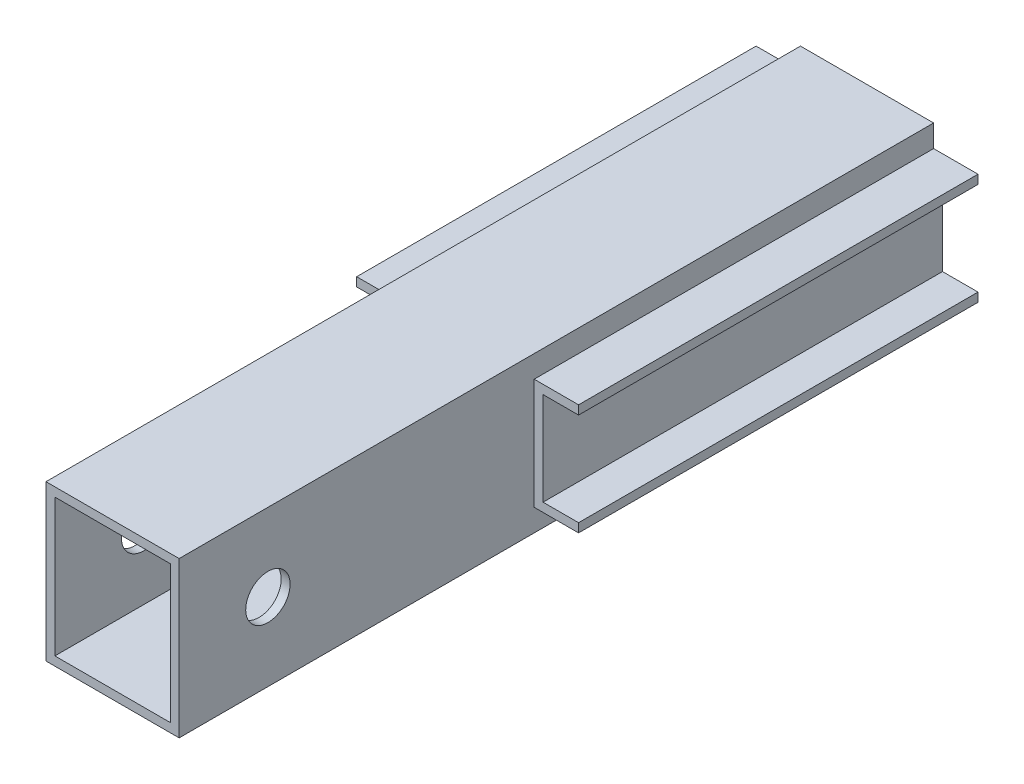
ISO-10303-21;
HEADER;
FILE_DESCRIPTION(('STEP AP214'),'2;1');
FILE_NAME('part.step','',(''),(''),'','','');
FILE_SCHEMA(('AUTOMOTIVE_DESIGN { 1 0 10303 214 1 1 1 1 }'));
ENDSEC;
DATA;
#1=APPLICATION_CONTEXT('core data for automotive mechanical design processes');
#2=APPLICATION_PROTOCOL_DEFINITION('international standard','automotive_design',2000,#1);
#3=PRODUCT_CONTEXT('',#1,'mechanical');
#4=PRODUCT('Part','Part','',(#3));
#5=PRODUCT_RELATED_PRODUCT_CATEGORY('part','',(#4));
#6=PRODUCT_DEFINITION_FORMATION('','',#4);
#7=PRODUCT_DEFINITION_CONTEXT('part definition',#1,'design');
#8=PRODUCT_DEFINITION('design','',#6,#7);
#9=PRODUCT_DEFINITION_SHAPE('','',#8);
#10=(LENGTH_UNIT() NAMED_UNIT(*) SI_UNIT(.MILLI.,.METRE.));
#11=(NAMED_UNIT(*) PLANE_ANGLE_UNIT() SI_UNIT($,.RADIAN.));
#12=(NAMED_UNIT(*) SI_UNIT($,.STERADIAN.) SOLID_ANGLE_UNIT());
#13=UNCERTAINTY_MEASURE_WITH_UNIT(LENGTH_MEASURE(1.E-05),#10,'distance_accuracy_value','');
#14=(GEOMETRIC_REPRESENTATION_CONTEXT(3) GLOBAL_UNCERTAINTY_ASSIGNED_CONTEXT((#13)) GLOBAL_UNIT_ASSIGNED_CONTEXT((#10,
#11,#12)) REPRESENTATION_CONTEXT('',''));
#15=CARTESIAN_POINT('',(0.,0.,0.));
#16=DIRECTION('',(0.,0.,1.));
#17=DIRECTION('',(1.,0.,0.));
#18=AXIS2_PLACEMENT_3D('',#15,#16,#17);
#19=CARTESIAN_POINT('',(15.,17.5,530.));
#20=DIRECTION('',(-1.,0.,0.));
#21=DIRECTION('',(0.,0.,1.));
#22=AXIS2_PLACEMENT_3D('',#19,#20,#21);
#23=PLANE('',#22);
#24=CARTESIAN_POINT('',(15.,0.,510.));
#25=DIRECTION('',(1.,0.,0.));
#26=DIRECTION('',(0.,1.,0.));
#27=AXIS2_PLACEMENT_3D('',#24,#25,#26);
#28=CIRCLE('',#27,5.00000000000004);
#29=CARTESIAN_POINT('',(15.,5.00000000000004,510.));
#30=VERTEX_POINT('',#29);
#31=EDGE_CURVE('E220',#30,#30,#28,.T.);
#32=ORIENTED_EDGE('',*,*,#31,.F.);
#33=EDGE_LOOP('',(#32));
#34=FACE_BOUND('',#33,.T.);
#35=DIRECTION('',(0.,0.,-1.));
#36=VECTOR('',#35,1.);
#37=CARTESIAN_POINT('',(15.,-17.5,530.));
#38=LINE('',#37,#36);
#39=CARTESIAN_POINT('',(15.,-17.5,530.));
#40=VERTEX_POINT('',#39);
#41=CARTESIAN_POINT('',(15.,-17.5,360.));
#42=VERTEX_POINT('',#41);
#43=EDGE_CURVE('E214',#40,#42,#38,.T.);
#44=ORIENTED_EDGE('',*,*,#43,.T.);
#45=DIRECTION('',(0.,1.,0.));
#46=VECTOR('',#45,1.);
#47=CARTESIAN_POINT('',(15.,17.5,360.));
#48=LINE('',#47,#46);
#49=CARTESIAN_POINT('',(15.,-12.5,360.));
#50=VERTEX_POINT('',#49);
#51=EDGE_CURVE('E359',#42,#50,#48,.T.);
#52=ORIENTED_EDGE('',*,*,#51,.T.);
#53=DIRECTION('',(0.,0.,-1.));
#54=VECTOR('',#53,1.);
#55=CARTESIAN_POINT('',(15.,-12.5,450.));
#56=LINE('',#55,#54);
#57=CARTESIAN_POINT('',(15.,-12.5,450.));
#58=VERTEX_POINT('',#57);
#59=EDGE_CURVE('E305',#58,#50,#56,.T.);
#60=ORIENTED_EDGE('',*,*,#59,.F.);
#61=DIRECTION('',(0.,-1.,0.));
#62=VECTOR('',#61,1.);
#63=CARTESIAN_POINT('',(15.,12.5,450.));
#64=LINE('',#63,#62);
#65=CARTESIAN_POINT('',(15.,12.5,450.));
#66=VERTEX_POINT('',#65);
#67=EDGE_CURVE('E297',#66,#58,#64,.T.);
#68=ORIENTED_EDGE('',*,*,#67,.F.);
#69=DIRECTION('',(0.,0.,-1.));
#70=VECTOR('',#69,1.);
#71=CARTESIAN_POINT('',(15.,12.5,450.));
#72=LINE('',#71,#70);
#73=CARTESIAN_POINT('',(15.,12.5,360.));
#74=VERTEX_POINT('',#73);
#75=EDGE_CURVE('E308',#66,#74,#72,.T.);
#76=ORIENTED_EDGE('',*,*,#75,.T.);
#77=CARTESIAN_POINT('',(15.,17.5,360.));
#78=VERTEX_POINT('',#77);
#79=EDGE_CURVE('E384',#74,#78,#48,.T.);
#80=ORIENTED_EDGE('',*,*,#79,.T.);
#81=DIRECTION('',(0.,0.,-1.));
#82=VECTOR('',#81,1.);
#83=CARTESIAN_POINT('',(15.,17.5,530.));
#84=LINE('',#83,#82);
#85=CARTESIAN_POINT('',(15.,17.5,530.));
#86=VERTEX_POINT('',#85);
#87=EDGE_CURVE('E35',#86,#78,#84,.T.);
#88=ORIENTED_EDGE('',*,*,#87,.F.);
#89=DIRECTION('',(0.,1.,0.));
#90=VECTOR('',#89,1.);
#91=CARTESIAN_POINT('',(15.,17.5,530.));
#92=LINE('',#91,#90);
#93=EDGE_CURVE('E347',#40,#86,#92,.T.);
#94=ORIENTED_EDGE('',*,*,#93,.F.);
#95=EDGE_LOOP('',(#44,#52,#60,#68,#76,#80,#88,#94));
#96=FACE_BOUND('',#95,.T.);
#97=ADVANCED_FACE('F28',(#34,#96),#23,.F.);
#98=CARTESIAN_POINT('',(15.,17.5,530.));
#99=DIRECTION('',(0.,0.,1.));
#100=DIRECTION('',(1.,0.,0.));
#101=AXIS2_PLACEMENT_3D('',#98,#99,#100);
#102=PLANE('',#101);
#103=ORIENTED_EDGE('',*,*,#93,.T.);
#104=DIRECTION('',(-1.,0.,0.));
#105=VECTOR('',#104,1.);
#106=CARTESIAN_POINT('',(-15.,17.5,530.));
#107=LINE('',#106,#105);
#108=CARTESIAN_POINT('',(-15.,17.5,530.));
#109=VERTEX_POINT('',#108);
#110=EDGE_CURVE('E350',#86,#109,#107,.T.);
#111=ORIENTED_EDGE('',*,*,#110,.T.);
#112=DIRECTION('',(0.,-1.,0.));
#113=VECTOR('',#112,1.);
#114=CARTESIAN_POINT('',(-15.,17.5,530.));
#115=LINE('',#114,#113);
#116=CARTESIAN_POINT('',(-15.,-17.5,530.));
#117=VERTEX_POINT('',#116);
#118=EDGE_CURVE('E209',#109,#117,#115,.T.);
#119=ORIENTED_EDGE('',*,*,#118,.T.);
#120=DIRECTION('',(1.,0.,0.));
#121=VECTOR('',#120,1.);
#122=CARTESIAN_POINT('',(-15.,-17.5,530.));
#123=LINE('',#122,#121);
#124=EDGE_CURVE('E353',#117,#40,#123,.T.);
#125=ORIENTED_EDGE('',*,*,#124,.T.);
#126=EDGE_LOOP('',(#103,#111,#119,#125));
#127=FACE_BOUND('',#126,.T.);
#128=DIRECTION('',(-1.,0.,0.));
#129=VECTOR('',#128,1.);
#130=CARTESIAN_POINT('',(-13.,15.5,530.));
#131=LINE('',#130,#129);
#132=CARTESIAN_POINT('',(13.,15.5,530.));
#133=VERTEX_POINT('',#132);
#134=CARTESIAN_POINT('',(-13.,15.5,530.));
#135=VERTEX_POINT('',#134);
#136=EDGE_CURVE('E328',#133,#135,#131,.T.);
#137=ORIENTED_EDGE('',*,*,#136,.F.);
#138=DIRECTION('',(0.,1.,0.));
#139=VECTOR('',#138,1.);
#140=CARTESIAN_POINT('',(13.,15.5,530.));
#141=LINE('',#140,#139);
#142=CARTESIAN_POINT('',(13.,-15.5,530.));
#143=VERTEX_POINT('',#142);
#144=EDGE_CURVE('E326',#143,#133,#141,.T.);
#145=ORIENTED_EDGE('',*,*,#144,.F.);
#146=DIRECTION('',(1.,0.,0.));
#147=VECTOR('',#146,1.);
#148=CARTESIAN_POINT('',(-13.,-15.5,530.));
#149=LINE('',#148,#147);
#150=CARTESIAN_POINT('',(-13.,-15.5,530.));
#151=VERTEX_POINT('',#150);
#152=EDGE_CURVE('E333',#151,#143,#149,.T.);
#153=ORIENTED_EDGE('',*,*,#152,.F.);
#154=DIRECTION('',(0.,-1.,0.));
#155=VECTOR('',#154,1.);
#156=CARTESIAN_POINT('',(-13.,15.5,530.));
#157=LINE('',#156,#155);
#158=EDGE_CURVE('E330',#135,#151,#157,.T.);
#159=ORIENTED_EDGE('',*,*,#158,.F.);
#160=EDGE_LOOP('',(#137,#145,#153,#159));
#161=FACE_BOUND('',#160,.T.);
#162=ADVANCED_FACE('F414',(#127,#161),#102,.T.);
#163=CARTESIAN_POINT('',(-15.,17.5,530.));
#164=DIRECTION('',(0.,-1.,0.));
#165=DIRECTION('',(0.,0.,-1.));
#166=AXIS2_PLACEMENT_3D('',#163,#164,#165);
#167=PLANE('',#166);
#168=ORIENTED_EDGE('',*,*,#87,.T.);
#169=DIRECTION('',(1.,0.,0.));
#170=VECTOR('',#169,1.);
#171=CARTESIAN_POINT('',(51.143348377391,17.5,360.));
#172=LINE('',#171,#170);
#173=CARTESIAN_POINT('',(-15.,17.5,360.));
#174=VERTEX_POINT('',#173);
#175=EDGE_CURVE('E188',#174,#78,#172,.T.);
#176=ORIENTED_EDGE('',*,*,#175,.F.);
#177=DIRECTION('',(0.,0.,-1.));
#178=VECTOR('',#177,1.);
#179=CARTESIAN_POINT('',(-15.,17.5,530.));
#180=LINE('',#179,#178);
#181=EDGE_CURVE('E202',#109,#174,#180,.T.);
#182=ORIENTED_EDGE('',*,*,#181,.F.);
#183=ORIENTED_EDGE('',*,*,#110,.F.);
#184=EDGE_LOOP('',(#168,#176,#182,#183));
#185=FACE_BOUND('',#184,.T.);
#186=ADVANCED_FACE('F201',(#185),#167,.F.);
#187=CARTESIAN_POINT('',(-15.,17.5,530.));
#188=DIRECTION('',(1.,0.,0.));
#189=DIRECTION('',(0.,1.,0.));
#190=AXIS2_PLACEMENT_3D('',#187,#188,#189);
#191=PLANE('',#190);
#192=CARTESIAN_POINT('',(-15.,0.,510.));
#193=DIRECTION('',(1.,0.,0.));
#194=DIRECTION('',(0.,1.,0.));
#195=AXIS2_PLACEMENT_3D('',#192,#193,#194);
#196=CIRCLE('',#195,5.00000000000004);
#197=CARTESIAN_POINT('',(-15.,5.00000000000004,510.));
#198=VERTEX_POINT('',#197);
#199=EDGE_CURVE('E224',#198,#198,#196,.T.);
#200=ORIENTED_EDGE('',*,*,#199,.T.);
#201=EDGE_LOOP('',(#200));
#202=FACE_BOUND('',#201,.T.);
#203=ORIENTED_EDGE('',*,*,#181,.T.);
#204=DIRECTION('',(0.,-1.,0.));
#205=VECTOR('',#204,1.);
#206=CARTESIAN_POINT('',(-15.,17.5,360.));
#207=LINE('',#206,#205);
#208=CARTESIAN_POINT('',(-15.,12.5,360.));
#209=VERTEX_POINT('',#208);
#210=EDGE_CURVE('E185',#174,#209,#207,.T.);
#211=ORIENTED_EDGE('',*,*,#210,.T.);
#212=DIRECTION('',(0.,0.,-1.));
#213=VECTOR('',#212,1.);
#214=CARTESIAN_POINT('',(-15.,12.5,450.));
#215=LINE('',#214,#213);
#216=CARTESIAN_POINT('',(-15.,12.5,450.));
#217=VERTEX_POINT('',#216);
#218=EDGE_CURVE('E275',#217,#209,#215,.T.);
#219=ORIENTED_EDGE('',*,*,#218,.F.);
#220=DIRECTION('',(0.,-1.,0.));
#221=VECTOR('',#220,1.);
#222=CARTESIAN_POINT('',(-15.,12.5,450.));
#223=LINE('',#222,#221);
#224=CARTESIAN_POINT('',(-15.,-12.5,450.));
#225=VERTEX_POINT('',#224);
#226=EDGE_CURVE('E243',#217,#225,#223,.T.);
#227=ORIENTED_EDGE('',*,*,#226,.T.);
#228=DIRECTION('',(0.,0.,-1.));
#229=VECTOR('',#228,1.);
#230=CARTESIAN_POINT('',(-15.,-12.5,450.));
#231=LINE('',#230,#229);
#232=CARTESIAN_POINT('',(-15.,-12.5,360.));
#233=VERTEX_POINT('',#232);
#234=EDGE_CURVE('E277',#225,#233,#231,.T.);
#235=ORIENTED_EDGE('',*,*,#234,.T.);
#236=CARTESIAN_POINT('',(-15.,-17.5,360.));
#237=VERTEX_POINT('',#236);
#238=EDGE_CURVE('E197',#233,#237,#207,.T.);
#239=ORIENTED_EDGE('',*,*,#238,.T.);
#240=DIRECTION('',(0.,0.,-1.));
#241=VECTOR('',#240,1.);
#242=CARTESIAN_POINT('',(-15.,-17.5,530.));
#243=LINE('',#242,#241);
#244=EDGE_CURVE('E210',#117,#237,#243,.T.);
#245=ORIENTED_EDGE('',*,*,#244,.F.);
#246=ORIENTED_EDGE('',*,*,#118,.F.);
#247=EDGE_LOOP('',(#203,#211,#219,#227,#235,#239,#245,#246));
#248=FACE_BOUND('',#247,.T.);
#249=ADVANCED_FACE('F207',(#202,#248),#191,.F.);
#250=CARTESIAN_POINT('',(-15.,-17.5,530.));
#251=DIRECTION('',(0.,1.,0.));
#252=DIRECTION('',(-1.,0.,0.));
#253=AXIS2_PLACEMENT_3D('',#250,#251,#252);
#254=PLANE('',#253);
#255=ORIENTED_EDGE('',*,*,#244,.T.);
#256=DIRECTION('',(1.,0.,0.));
#257=VECTOR('',#256,1.);
#258=CARTESIAN_POINT('',(51.143348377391,-17.5,360.));
#259=LINE('',#258,#257);
#260=EDGE_CURVE('E205',#237,#42,#259,.T.);
#261=ORIENTED_EDGE('',*,*,#260,.T.);
#262=ORIENTED_EDGE('',*,*,#43,.F.);
#263=ORIENTED_EDGE('',*,*,#124,.F.);
#264=EDGE_LOOP('',(#255,#261,#262,#263));
#265=FACE_BOUND('',#264,.T.);
#266=ADVANCED_FACE('F363',(#265),#254,.F.);
#267=CARTESIAN_POINT('',(13.,15.5,530.));
#268=DIRECTION('',(-1.,0.,0.));
#269=DIRECTION('',(0.,-1.,0.));
#270=AXIS2_PLACEMENT_3D('',#267,#268,#269);
#271=PLANE('',#270);
#272=DIRECTION('',(0.,1.,0.));
#273=VECTOR('',#272,1.);
#274=CARTESIAN_POINT('',(13.,15.5,360.));
#275=LINE('',#274,#273);
#276=CARTESIAN_POINT('',(13.,-15.5,360.));
#277=VERTEX_POINT('',#276);
#278=CARTESIAN_POINT('',(13.,15.5,360.));
#279=VERTEX_POINT('',#278);
#280=EDGE_CURVE('E227',#277,#279,#275,.T.);
#281=ORIENTED_EDGE('',*,*,#280,.F.);
#282=DIRECTION('',(0.,0.,-1.));
#283=VECTOR('',#282,1.);
#284=CARTESIAN_POINT('',(13.,-15.5,530.));
#285=LINE('',#284,#283);
#286=EDGE_CURVE('E335',#143,#277,#285,.T.);
#287=ORIENTED_EDGE('',*,*,#286,.F.);
#288=ORIENTED_EDGE('',*,*,#144,.T.);
#289=DIRECTION('',(0.,0.,-1.));
#290=VECTOR('',#289,1.);
#291=CARTESIAN_POINT('',(13.,15.5,530.));
#292=LINE('',#291,#290);
#293=EDGE_CURVE('E344',#133,#279,#292,.T.);
#294=ORIENTED_EDGE('',*,*,#293,.T.);
#295=EDGE_LOOP('',(#281,#287,#288,#294));
#296=FACE_BOUND('',#295,.T.);
#297=CARTESIAN_POINT('',(13.,0.,510.));
#298=DIRECTION('',(-1.,0.,0.));
#299=DIRECTION('',(0.,-1.,0.));
#300=AXIS2_PLACEMENT_3D('',#297,#298,#299);
#301=CIRCLE('',#300,5.00000000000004);
#302=CARTESIAN_POINT('',(13.,-5.00000000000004,510.));
#303=VERTEX_POINT('',#302);
#304=EDGE_CURVE('E219',#303,#303,#301,.T.);
#305=ORIENTED_EDGE('',*,*,#304,.F.);
#306=EDGE_LOOP('',(#305));
#307=FACE_BOUND('',#306,.T.);
#308=ADVANCED_FACE('F420',(#296,#307),#271,.T.);
#309=CARTESIAN_POINT('',(-13.,15.5,530.));
#310=DIRECTION('',(0.,-1.,0.));
#311=DIRECTION('',(0.,0.,-1.));
#312=AXIS2_PLACEMENT_3D('',#309,#310,#311);
#313=PLANE('',#312);
#314=DIRECTION('',(-1.,0.,0.));
#315=VECTOR('',#314,1.);
#316=CARTESIAN_POINT('',(-13.,15.5,360.));
#317=LINE('',#316,#315);
#318=CARTESIAN_POINT('',(-13.,15.5,360.));
#319=VERTEX_POINT('',#318);
#320=EDGE_CURVE('E231',#279,#319,#317,.T.);
#321=ORIENTED_EDGE('',*,*,#320,.F.);
#322=ORIENTED_EDGE('',*,*,#293,.F.);
#323=ORIENTED_EDGE('',*,*,#136,.T.);
#324=DIRECTION('',(0.,0.,-1.));
#325=VECTOR('',#324,1.);
#326=CARTESIAN_POINT('',(-13.,15.5,530.));
#327=LINE('',#326,#325);
#328=EDGE_CURVE('E341',#135,#319,#327,.T.);
#329=ORIENTED_EDGE('',*,*,#328,.T.);
#330=EDGE_LOOP('',(#321,#322,#323,#329));
#331=FACE_BOUND('',#330,.T.);
#332=ADVANCED_FACE('F410',(#331),#313,.T.);
#333=CARTESIAN_POINT('',(-13.,15.5,530.));
#334=DIRECTION('',(1.,0.,0.));
#335=DIRECTION('',(0.,1.,0.));
#336=AXIS2_PLACEMENT_3D('',#333,#334,#335);
#337=PLANE('',#336);
#338=DIRECTION('',(0.,-1.,0.));
#339=VECTOR('',#338,1.);
#340=CARTESIAN_POINT('',(-13.,15.5,360.));
#341=LINE('',#340,#339);
#342=CARTESIAN_POINT('',(-13.,-15.5,360.));
#343=VERTEX_POINT('',#342);
#344=EDGE_CURVE('E42',#319,#343,#341,.T.);
#345=ORIENTED_EDGE('',*,*,#344,.F.);
#346=ORIENTED_EDGE('',*,*,#328,.F.);
#347=ORIENTED_EDGE('',*,*,#158,.T.);
#348=DIRECTION('',(0.,0.,-1.));
#349=VECTOR('',#348,1.);
#350=CARTESIAN_POINT('',(-13.,-15.5,530.));
#351=LINE('',#350,#349);
#352=EDGE_CURVE('E338',#151,#343,#351,.T.);
#353=ORIENTED_EDGE('',*,*,#352,.T.);
#354=EDGE_LOOP('',(#345,#346,#347,#353));
#355=FACE_BOUND('',#354,.T.);
#356=CARTESIAN_POINT('',(-13.,0.,510.));
#357=DIRECTION('',(1.,0.,0.));
#358=DIRECTION('',(0.,1.,0.));
#359=AXIS2_PLACEMENT_3D('',#356,#357,#358);
#360=CIRCLE('',#359,5.00000000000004);
#361=CARTESIAN_POINT('',(-13.,5.00000000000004,510.));
#362=VERTEX_POINT('',#361);
#363=EDGE_CURVE('E217',#362,#362,#360,.T.);
#364=ORIENTED_EDGE('',*,*,#363,.F.);
#365=EDGE_LOOP('',(#364));
#366=FACE_BOUND('',#365,.T.);
#367=ADVANCED_FACE('F407',(#355,#366),#337,.T.);
#368=CARTESIAN_POINT('',(-13.,-15.5,530.));
#369=DIRECTION('',(0.,1.,0.));
#370=DIRECTION('',(0.,0.,1.));
#371=AXIS2_PLACEMENT_3D('',#368,#369,#370);
#372=PLANE('',#371);
#373=DIRECTION('',(1.,0.,0.));
#374=VECTOR('',#373,1.);
#375=CARTESIAN_POINT('',(-13.,-15.5,360.));
#376=LINE('',#375,#374);
#377=EDGE_CURVE('E399',#343,#277,#376,.T.);
#378=ORIENTED_EDGE('',*,*,#377,.F.);
#379=ORIENTED_EDGE('',*,*,#352,.F.);
#380=ORIENTED_EDGE('',*,*,#152,.T.);
#381=ORIENTED_EDGE('',*,*,#286,.T.);
#382=EDGE_LOOP('',(#378,#379,#380,#381));
#383=FACE_BOUND('',#382,.T.);
#384=ADVANCED_FACE('F418',(#383),#372,.T.);
#385=CARTESIAN_POINT('',(25.,-12.5,450.));
#386=DIRECTION('',(-1.,0.,0.));
#387=DIRECTION('',(0.,0.,1.));
#388=AXIS2_PLACEMENT_3D('',#385,#386,#387);
#389=PLANE('',#388);
#390=DIRECTION('',(0.,0.,-1.));
#391=VECTOR('',#390,1.);
#392=CARTESIAN_POINT('',(25.,-12.5,450.));
#393=LINE('',#392,#391);
#394=CARTESIAN_POINT('',(25.,-12.5,450.));
#395=VERTEX_POINT('',#394);
#396=CARTESIAN_POINT('',(25.,-12.5,360.));
#397=VERTEX_POINT('',#396);
#398=EDGE_CURVE('E302',#395,#397,#393,.T.);
#399=ORIENTED_EDGE('',*,*,#398,.T.);
#400=DIRECTION('',(0.,1.,0.));
#401=VECTOR('',#400,1.);
#402=CARTESIAN_POINT('',(25.,-12.5,360.));
#403=LINE('',#402,#401);
#404=CARTESIAN_POINT('',(25.,-10.5,360.));
#405=VERTEX_POINT('',#404);
#406=EDGE_CURVE('E379',#397,#405,#403,.T.);
#407=ORIENTED_EDGE('',*,*,#406,.T.);
#408=DIRECTION('',(0.,0.,-1.));
#409=VECTOR('',#408,1.);
#410=CARTESIAN_POINT('',(25.,-10.5,450.));
#411=LINE('',#410,#409);
#412=CARTESIAN_POINT('',(25.,-10.5,450.));
#413=VERTEX_POINT('',#412);
#414=EDGE_CURVE('E323',#413,#405,#411,.T.);
#415=ORIENTED_EDGE('',*,*,#414,.F.);
#416=DIRECTION('',(0.,1.,0.));
#417=VECTOR('',#416,1.);
#418=CARTESIAN_POINT('',(25.,-12.5,450.));
#419=LINE('',#418,#417);
#420=EDGE_CURVE('E283',#395,#413,#419,.T.);
#421=ORIENTED_EDGE('',*,*,#420,.F.);
#422=EDGE_LOOP('',(#399,#407,#415,#421));
#423=FACE_BOUND('',#422,.T.);
#424=ADVANCED_FACE('F484',(#423),#389,.F.);
#425=CARTESIAN_POINT('',(25.,-10.5,450.));
#426=DIRECTION('',(0.,-1.,0.));
#427=DIRECTION('',(0.,0.,-1.));
#428=AXIS2_PLACEMENT_3D('',#425,#426,#427);
#429=PLANE('',#428);
#430=ORIENTED_EDGE('',*,*,#414,.T.);
#431=DIRECTION('',(-1.,0.,0.));
#432=VECTOR('',#431,1.);
#433=CARTESIAN_POINT('',(25.,-10.5,360.));
#434=LINE('',#433,#432);
#435=CARTESIAN_POINT('',(17.,-10.5,360.));
#436=VERTEX_POINT('',#435);
#437=EDGE_CURVE('E383',#405,#436,#434,.T.);
#438=ORIENTED_EDGE('',*,*,#437,.T.);
#439=DIRECTION('',(0.,0.,-1.));
#440=VECTOR('',#439,1.);
#441=CARTESIAN_POINT('',(17.,-10.5,450.));
#442=LINE('',#441,#440);
#443=CARTESIAN_POINT('',(17.,-10.5,450.));
#444=VERTEX_POINT('',#443);
#445=EDGE_CURVE('E320',#444,#436,#442,.T.);
#446=ORIENTED_EDGE('',*,*,#445,.F.);
#447=DIRECTION('',(-1.,0.,0.));
#448=VECTOR('',#447,1.);
#449=CARTESIAN_POINT('',(25.,-10.5,450.));
#450=LINE('',#449,#448);
#451=EDGE_CURVE('E286',#413,#444,#450,.T.);
#452=ORIENTED_EDGE('',*,*,#451,.F.);
#453=EDGE_LOOP('',(#430,#438,#446,#452));
#454=FACE_BOUND('',#453,.T.);
#455=ADVANCED_FACE('F491',(#454),#429,.F.);
#456=CARTESIAN_POINT('',(17.,-10.5,450.));
#457=DIRECTION('',(-1.,0.,0.));
#458=DIRECTION('',(0.,0.,1.));
#459=AXIS2_PLACEMENT_3D('',#456,#457,#458);
#460=PLANE('',#459);
#461=ORIENTED_EDGE('',*,*,#445,.T.);
#462=DIRECTION('',(0.,1.,0.));
#463=VECTOR('',#462,1.);
#464=CARTESIAN_POINT('',(17.,-10.5,360.));
#465=LINE('',#464,#463);
#466=CARTESIAN_POINT('',(17.,10.5,360.));
#467=VERTEX_POINT('',#466);
#468=EDGE_CURVE('E387',#436,#467,#465,.T.);
#469=ORIENTED_EDGE('',*,*,#468,.T.);
#470=DIRECTION('',(0.,0.,-1.));
#471=VECTOR('',#470,1.);
#472=CARTESIAN_POINT('',(17.,10.5,450.));
#473=LINE('',#472,#471);
#474=CARTESIAN_POINT('',(17.,10.5,450.));
#475=VERTEX_POINT('',#474);
#476=EDGE_CURVE('E317',#475,#467,#473,.T.);
#477=ORIENTED_EDGE('',*,*,#476,.F.);
#478=DIRECTION('',(0.,1.,0.));
#479=VECTOR('',#478,1.);
#480=CARTESIAN_POINT('',(17.,-10.5,450.));
#481=LINE('',#480,#479);
#482=EDGE_CURVE('E288',#444,#475,#481,.T.);
#483=ORIENTED_EDGE('',*,*,#482,.F.);
#484=EDGE_LOOP('',(#461,#469,#477,#483));
#485=FACE_BOUND('',#484,.T.);
#486=ADVANCED_FACE('F499',(#485),#460,.F.);
#487=CARTESIAN_POINT('',(17.,10.5,450.));
#488=DIRECTION('',(0.,1.,0.));
#489=DIRECTION('',(0.,0.,1.));
#490=AXIS2_PLACEMENT_3D('',#487,#488,#489);
#491=PLANE('',#490);
#492=ORIENTED_EDGE('',*,*,#476,.T.);
#493=DIRECTION('',(1.,0.,0.));
#494=VECTOR('',#493,1.);
#495=CARTESIAN_POINT('',(17.,10.5,360.));
#496=LINE('',#495,#494);
#497=CARTESIAN_POINT('',(25.,10.5,360.));
#498=VERTEX_POINT('',#497);
#499=EDGE_CURVE('E390',#467,#498,#496,.T.);
#500=ORIENTED_EDGE('',*,*,#499,.T.);
#501=DIRECTION('',(0.,0.,-1.));
#502=VECTOR('',#501,1.);
#503=CARTESIAN_POINT('',(25.,10.5,450.));
#504=LINE('',#503,#502);
#505=CARTESIAN_POINT('',(25.,10.5,450.));
#506=VERTEX_POINT('',#505);
#507=EDGE_CURVE('E314',#506,#498,#504,.T.);
#508=ORIENTED_EDGE('',*,*,#507,.F.);
#509=DIRECTION('',(1.,0.,0.));
#510=VECTOR('',#509,1.);
#511=CARTESIAN_POINT('',(17.,10.5,450.));
#512=LINE('',#511,#510);
#513=EDGE_CURVE('E290',#475,#506,#512,.T.);
#514=ORIENTED_EDGE('',*,*,#513,.F.);
#515=EDGE_LOOP('',(#492,#500,#508,#514));
#516=FACE_BOUND('',#515,.T.);
#517=ADVANCED_FACE('F507',(#516),#491,.F.);
#518=CARTESIAN_POINT('',(25.,10.5,450.));
#519=DIRECTION('',(-1.,0.,0.));
#520=DIRECTION('',(0.,0.,1.));
#521=AXIS2_PLACEMENT_3D('',#518,#519,#520);
#522=PLANE('',#521);
#523=ORIENTED_EDGE('',*,*,#507,.T.);
#524=DIRECTION('',(0.,1.,0.));
#525=VECTOR('',#524,1.);
#526=CARTESIAN_POINT('',(25.,10.5,360.));
#527=LINE('',#526,#525);
#528=CARTESIAN_POINT('',(25.,12.5,360.));
#529=VERTEX_POINT('',#528);
#530=EDGE_CURVE('E393',#498,#529,#527,.T.);
#531=ORIENTED_EDGE('',*,*,#530,.T.);
#532=DIRECTION('',(0.,0.,-1.));
#533=VECTOR('',#532,1.);
#534=CARTESIAN_POINT('',(25.,12.5,450.));
#535=LINE('',#534,#533);
#536=CARTESIAN_POINT('',(25.,12.5,450.));
#537=VERTEX_POINT('',#536);
#538=EDGE_CURVE('E311',#537,#529,#535,.T.);
#539=ORIENTED_EDGE('',*,*,#538,.F.);
#540=DIRECTION('',(0.,1.,0.));
#541=VECTOR('',#540,1.);
#542=CARTESIAN_POINT('',(25.,10.5,450.));
#543=LINE('',#542,#541);
#544=EDGE_CURVE('E292',#506,#537,#543,.T.);
#545=ORIENTED_EDGE('',*,*,#544,.F.);
#546=EDGE_LOOP('',(#523,#531,#539,#545));
#547=FACE_BOUND('',#546,.T.);
#548=ADVANCED_FACE('F515',(#547),#522,.F.);
#549=CARTESIAN_POINT('',(25.,12.5,450.));
#550=DIRECTION('',(0.,-1.,0.));
#551=DIRECTION('',(1.,0.,0.));
#552=AXIS2_PLACEMENT_3D('',#549,#550,#551);
#553=PLANE('',#552);
#554=ORIENTED_EDGE('',*,*,#538,.T.);
#555=DIRECTION('',(-1.,0.,0.));
#556=VECTOR('',#555,1.);
#557=CARTESIAN_POINT('',(25.,12.5,360.));
#558=LINE('',#557,#556);
#559=EDGE_CURVE('E396',#529,#74,#558,.T.);
#560=ORIENTED_EDGE('',*,*,#559,.T.);
#561=ORIENTED_EDGE('',*,*,#75,.F.);
#562=DIRECTION('',(-1.,0.,0.));
#563=VECTOR('',#562,1.);
#564=CARTESIAN_POINT('',(25.,12.5,450.));
#565=LINE('',#564,#563);
#566=EDGE_CURVE('E294',#537,#66,#565,.T.);
#567=ORIENTED_EDGE('',*,*,#566,.F.);
#568=EDGE_LOOP('',(#554,#560,#561,#567));
#569=FACE_BOUND('',#568,.T.);
#570=ADVANCED_FACE('F523',(#569),#553,.F.);
#571=CARTESIAN_POINT('',(15.,-12.5,450.));
#572=DIRECTION('',(0.,1.,0.));
#573=DIRECTION('',(0.,0.,1.));
#574=AXIS2_PLACEMENT_3D('',#571,#572,#573);
#575=PLANE('',#574);
#576=ORIENTED_EDGE('',*,*,#59,.T.);
#577=DIRECTION('',(1.,0.,0.));
#578=VECTOR('',#577,1.);
#579=CARTESIAN_POINT('',(15.,-12.5,360.));
#580=LINE('',#579,#578);
#581=EDGE_CURVE('E376',#50,#397,#580,.T.);
#582=ORIENTED_EDGE('',*,*,#581,.T.);
#583=ORIENTED_EDGE('',*,*,#398,.F.);
#584=DIRECTION('',(1.,0.,0.));
#585=VECTOR('',#584,1.);
#586=CARTESIAN_POINT('',(15.,-12.5,450.));
#587=LINE('',#586,#585);
#588=EDGE_CURVE('E300',#58,#395,#587,.T.);
#589=ORIENTED_EDGE('',*,*,#588,.F.);
#590=EDGE_LOOP('',(#576,#582,#583,#589));
#591=FACE_BOUND('',#590,.T.);
#592=ADVANCED_FACE('F531',(#591),#575,.F.);
#593=CARTESIAN_POINT('',(25.,-10.5,450.));
#594=DIRECTION('',(0.,0.,1.));
#595=DIRECTION('',(1.,0.,0.));
#596=AXIS2_PLACEMENT_3D('',#593,#594,#595);
#597=PLANE('',#596);
#598=ORIENTED_EDGE('',*,*,#420,.T.);
#599=ORIENTED_EDGE('',*,*,#451,.T.);
#600=ORIENTED_EDGE('',*,*,#482,.T.);
#601=ORIENTED_EDGE('',*,*,#513,.T.);
#602=ORIENTED_EDGE('',*,*,#544,.T.);
#603=ORIENTED_EDGE('',*,*,#566,.T.);
#604=ORIENTED_EDGE('',*,*,#67,.T.);
#605=ORIENTED_EDGE('',*,*,#588,.T.);
#606=EDGE_LOOP('',(#598,#599,#600,#601,#602,#603,#604,#605));
#607=FACE_BOUND('',#606,.T.);
#608=ADVANCED_FACE('F539',(#607),#597,.T.);
#609=CARTESIAN_POINT('',(-25.,-12.5,450.));
#610=DIRECTION('',(-1.,0.,0.));
#611=DIRECTION('',(0.,0.,1.));
#612=AXIS2_PLACEMENT_3D('',#609,#610,#611);
#613=PLANE('',#612);
#614=DIRECTION('',(0.,1.,0.));
#615=VECTOR('',#614,1.);
#616=CARTESIAN_POINT('',(-25.,-12.5,360.));
#617=LINE('',#616,#615);
#618=CARTESIAN_POINT('',(-25.,-12.5,360.));
#619=VERTEX_POINT('',#618);
#620=CARTESIAN_POINT('',(-25.,-10.5,360.));
#621=VERTEX_POINT('',#620);
#622=EDGE_CURVE('E49',#619,#621,#617,.T.);
#623=ORIENTED_EDGE('',*,*,#622,.F.);
#624=DIRECTION('',(0.,0.,-1.));
#625=VECTOR('',#624,1.);
#626=CARTESIAN_POINT('',(-25.,-12.5,450.));
#627=LINE('',#626,#625);
#628=CARTESIAN_POINT('',(-25.,-12.5,450.));
#629=VERTEX_POINT('',#628);
#630=EDGE_CURVE('E280',#629,#619,#627,.T.);
#631=ORIENTED_EDGE('',*,*,#630,.F.);
#632=DIRECTION('',(0.,1.,0.));
#633=VECTOR('',#632,1.);
#634=CARTESIAN_POINT('',(-25.,-12.5,450.));
#635=LINE('',#634,#633);
#636=CARTESIAN_POINT('',(-25.,-10.5,450.));
#637=VERTEX_POINT('',#636);
#638=EDGE_CURVE('E237',#629,#637,#635,.T.);
#639=ORIENTED_EDGE('',*,*,#638,.T.);
#640=DIRECTION('',(0.,0.,-1.));
#641=VECTOR('',#640,1.);
#642=CARTESIAN_POINT('',(-25.,-10.5,450.));
#643=LINE('',#642,#641);
#644=EDGE_CURVE('E260',#637,#621,#643,.T.);
#645=ORIENTED_EDGE('',*,*,#644,.T.);
#646=EDGE_LOOP('',(#623,#631,#639,#645));
#647=FACE_BOUND('',#646,.T.);
#648=ADVANCED_FACE('F547',(#647),#613,.T.);
#649=CARTESIAN_POINT('',(-15.,-12.5,450.));
#650=DIRECTION('',(0.,-1.,0.));
#651=DIRECTION('',(0.,0.,-1.));
#652=AXIS2_PLACEMENT_3D('',#649,#650,#651);
#653=PLANE('',#652);
#654=DIRECTION('',(-1.,0.,0.));
#655=VECTOR('',#654,1.);
#656=CARTESIAN_POINT('',(-15.,-12.5,360.));
#657=LINE('',#656,#655);
#658=EDGE_CURVE('E195',#233,#619,#657,.T.);
#659=ORIENTED_EDGE('',*,*,#658,.F.);
#660=ORIENTED_EDGE('',*,*,#234,.F.);
#661=DIRECTION('',(-1.,0.,0.));
#662=VECTOR('',#661,1.);
#663=CARTESIAN_POINT('',(-15.,-12.5,450.));
#664=LINE('',#663,#662);
#665=EDGE_CURVE('E240',#225,#629,#664,.T.);
#666=ORIENTED_EDGE('',*,*,#665,.T.);
#667=ORIENTED_EDGE('',*,*,#630,.T.);
#668=EDGE_LOOP('',(#659,#660,#666,#667));
#669=FACE_BOUND('',#668,.T.);
#670=ADVANCED_FACE('F555',(#669),#653,.T.);
#671=CARTESIAN_POINT('',(-25.,12.5,450.));
#672=DIRECTION('',(0.,1.,0.));
#673=DIRECTION('',(-1.,0.,0.));
#674=AXIS2_PLACEMENT_3D('',#671,#672,#673);
#675=PLANE('',#674);
#676=DIRECTION('',(1.,0.,0.));
#677=VECTOR('',#676,1.);
#678=CARTESIAN_POINT('',(-25.,12.5,360.));
#679=LINE('',#678,#677);
#680=CARTESIAN_POINT('',(-25.,12.5,360.));
#681=VERTEX_POINT('',#680);
#682=EDGE_CURVE('E191',#681,#209,#679,.T.);
#683=ORIENTED_EDGE('',*,*,#682,.F.);
#684=DIRECTION('',(0.,0.,-1.));
#685=VECTOR('',#684,1.);
#686=CARTESIAN_POINT('',(-25.,12.5,450.));
#687=LINE('',#686,#685);
#688=CARTESIAN_POINT('',(-25.,12.5,450.));
#689=VERTEX_POINT('',#688);
#690=EDGE_CURVE('E272',#689,#681,#687,.T.);
#691=ORIENTED_EDGE('',*,*,#690,.F.);
#692=DIRECTION('',(1.,0.,0.));
#693=VECTOR('',#692,1.);
#694=CARTESIAN_POINT('',(-25.,12.5,450.));
#695=LINE('',#694,#693);
#696=EDGE_CURVE('E245',#689,#217,#695,.T.);
#697=ORIENTED_EDGE('',*,*,#696,.T.);
#698=ORIENTED_EDGE('',*,*,#218,.T.);
#699=EDGE_LOOP('',(#683,#691,#697,#698));
#700=FACE_BOUND('',#699,.T.);
#701=ADVANCED_FACE('F563',(#700),#675,.T.);
#702=CARTESIAN_POINT('',(-25.,10.5,450.));
#703=DIRECTION('',(-1.,0.,0.));
#704=DIRECTION('',(0.,0.,1.));
#705=AXIS2_PLACEMENT_3D('',#702,#703,#704);
#706=PLANE('',#705);
#707=DIRECTION('',(0.,1.,0.));
#708=VECTOR('',#707,1.);
#709=CARTESIAN_POINT('',(-25.,10.5,360.));
#710=LINE('',#709,#708);
#711=CARTESIAN_POINT('',(-25.,10.5,360.));
#712=VERTEX_POINT('',#711);
#713=EDGE_CURVE('E371',#712,#681,#710,.T.);
#714=ORIENTED_EDGE('',*,*,#713,.F.);
#715=DIRECTION('',(0.,0.,-1.));
#716=VECTOR('',#715,1.);
#717=CARTESIAN_POINT('',(-25.,10.5,450.));
#718=LINE('',#717,#716);
#719=CARTESIAN_POINT('',(-25.,10.5,450.));
#720=VERTEX_POINT('',#719);
#721=EDGE_CURVE('E269',#720,#712,#718,.T.);
#722=ORIENTED_EDGE('',*,*,#721,.F.);
#723=DIRECTION('',(0.,1.,0.));
#724=VECTOR('',#723,1.);
#725=CARTESIAN_POINT('',(-25.,10.5,450.));
#726=LINE('',#725,#724);
#727=EDGE_CURVE('E248',#720,#689,#726,.T.);
#728=ORIENTED_EDGE('',*,*,#727,.T.);
#729=ORIENTED_EDGE('',*,*,#690,.T.);
#730=EDGE_LOOP('',(#714,#722,#728,#729));
#731=FACE_BOUND('',#730,.T.);
#732=ADVANCED_FACE('F571',(#731),#706,.T.);
#733=CARTESIAN_POINT('',(-17.,10.5,450.));
#734=DIRECTION('',(0.,-1.,0.));
#735=DIRECTION('',(0.,0.,-1.));
#736=AXIS2_PLACEMENT_3D('',#733,#734,#735);
#737=PLANE('',#736);
#738=DIRECTION('',(-1.,0.,0.));
#739=VECTOR('',#738,1.);
#740=CARTESIAN_POINT('',(-17.,10.5,360.));
#741=LINE('',#740,#739);
#742=CARTESIAN_POINT('',(-17.,10.5,360.));
#743=VERTEX_POINT('',#742);
#744=EDGE_CURVE('E367',#743,#712,#741,.T.);
#745=ORIENTED_EDGE('',*,*,#744,.F.);
#746=DIRECTION('',(0.,0.,-1.));
#747=VECTOR('',#746,1.);
#748=CARTESIAN_POINT('',(-17.,10.5,450.));
#749=LINE('',#748,#747);
#750=CARTESIAN_POINT('',(-17.,10.5,450.));
#751=VERTEX_POINT('',#750);
#752=EDGE_CURVE('E266',#751,#743,#749,.T.);
#753=ORIENTED_EDGE('',*,*,#752,.F.);
#754=DIRECTION('',(-1.,0.,0.));
#755=VECTOR('',#754,1.);
#756=CARTESIAN_POINT('',(-17.,10.5,450.));
#757=LINE('',#756,#755);
#758=EDGE_CURVE('E251',#751,#720,#757,.T.);
#759=ORIENTED_EDGE('',*,*,#758,.T.);
#760=ORIENTED_EDGE('',*,*,#721,.T.);
#761=EDGE_LOOP('',(#745,#753,#759,#760));
#762=FACE_BOUND('',#761,.T.);
#763=ADVANCED_FACE('F579',(#762),#737,.T.);
#764=CARTESIAN_POINT('',(-17.,-10.5,450.));
#765=DIRECTION('',(-1.,0.,0.));
#766=DIRECTION('',(0.,0.,1.));
#767=AXIS2_PLACEMENT_3D('',#764,#765,#766);
#768=PLANE('',#767);
#769=DIRECTION('',(0.,1.,0.));
#770=VECTOR('',#769,1.);
#771=CARTESIAN_POINT('',(-17.,-10.5,360.));
#772=LINE('',#771,#770);
#773=CARTESIAN_POINT('',(-17.,-10.5,360.));
#774=VERTEX_POINT('',#773);
#775=EDGE_CURVE('E365',#774,#743,#772,.T.);
#776=ORIENTED_EDGE('',*,*,#775,.F.);
#777=DIRECTION('',(0.,0.,-1.));
#778=VECTOR('',#777,1.);
#779=CARTESIAN_POINT('',(-17.,-10.5,450.));
#780=LINE('',#779,#778);
#781=CARTESIAN_POINT('',(-17.,-10.5,450.));
#782=VERTEX_POINT('',#781);
#783=EDGE_CURVE('E263',#782,#774,#780,.T.);
#784=ORIENTED_EDGE('',*,*,#783,.F.);
#785=DIRECTION('',(0.,1.,0.));
#786=VECTOR('',#785,1.);
#787=CARTESIAN_POINT('',(-17.,-10.5,450.));
#788=LINE('',#787,#786);
#789=EDGE_CURVE('E254',#782,#751,#788,.T.);
#790=ORIENTED_EDGE('',*,*,#789,.T.);
#791=ORIENTED_EDGE('',*,*,#752,.T.);
#792=EDGE_LOOP('',(#776,#784,#790,#791));
#793=FACE_BOUND('',#792,.T.);
#794=ADVANCED_FACE('F587',(#793),#768,.T.);
#795=CARTESIAN_POINT('',(-25.,-10.5,450.));
#796=DIRECTION('',(0.,1.,0.));
#797=DIRECTION('',(0.,0.,1.));
#798=AXIS2_PLACEMENT_3D('',#795,#796,#797);
#799=PLANE('',#798);
#800=DIRECTION('',(1.,0.,0.));
#801=VECTOR('',#800,1.);
#802=CARTESIAN_POINT('',(-25.,-10.5,360.));
#803=LINE('',#802,#801);
#804=EDGE_CURVE('E11',#621,#774,#803,.T.);
#805=ORIENTED_EDGE('',*,*,#804,.F.);
#806=ORIENTED_EDGE('',*,*,#644,.F.);
#807=DIRECTION('',(1.,0.,0.));
#808=VECTOR('',#807,1.);
#809=CARTESIAN_POINT('',(-25.,-10.5,450.));
#810=LINE('',#809,#808);
#811=EDGE_CURVE('E257',#637,#782,#810,.T.);
#812=ORIENTED_EDGE('',*,*,#811,.T.);
#813=ORIENTED_EDGE('',*,*,#783,.T.);
#814=EDGE_LOOP('',(#805,#806,#812,#813));
#815=FACE_BOUND('',#814,.T.);
#816=ADVANCED_FACE('F595',(#815),#799,.T.);
#817=CARTESIAN_POINT('',(-25.,-10.5,450.));
#818=DIRECTION('',(0.,0.,1.));
#819=DIRECTION('',(-1.,0.,0.));
#820=AXIS2_PLACEMENT_3D('',#817,#818,#819);
#821=PLANE('',#820);
#822=ORIENTED_EDGE('',*,*,#638,.F.);
#823=ORIENTED_EDGE('',*,*,#665,.F.);
#824=ORIENTED_EDGE('',*,*,#226,.F.);
#825=ORIENTED_EDGE('',*,*,#696,.F.);
#826=ORIENTED_EDGE('',*,*,#727,.F.);
#827=ORIENTED_EDGE('',*,*,#758,.F.);
#828=ORIENTED_EDGE('',*,*,#789,.F.);
#829=ORIENTED_EDGE('',*,*,#811,.F.);
#830=EDGE_LOOP('',(#822,#823,#824,#825,#826,#827,#828,#829));
#831=FACE_BOUND('',#830,.T.);
#832=ADVANCED_FACE('F435',(#831),#821,.T.);
#833=CARTESIAN_POINT('',(-25.,0.,510.));
#834=DIRECTION('',(1.,0.,0.));
#835=DIRECTION('',(0.,1.,0.));
#836=AXIS2_PLACEMENT_3D('',#833,#834,#835);
#837=CYLINDRICAL_SURFACE('',#836,5.00000000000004);
#838=ORIENTED_EDGE('',*,*,#363,.T.);
#839=EDGE_LOOP('',(#838));
#840=FACE_BOUND('',#839,.T.);
#841=ORIENTED_EDGE('',*,*,#199,.F.);
#842=EDGE_LOOP('',(#841));
#843=FACE_BOUND('',#842,.T.);
#844=ADVANCED_FACE('F428',(#840,#843),#837,.F.);
#845=ORIENTED_EDGE('',*,*,#304,.T.);
#846=EDGE_LOOP('',(#845));
#847=FACE_BOUND('',#846,.T.);
#848=ORIENTED_EDGE('',*,*,#31,.T.);
#849=EDGE_LOOP('',(#848));
#850=FACE_BOUND('',#849,.T.);
#851=ADVANCED_FACE('F426',(#847,#850),#837,.F.);
#852=CARTESIAN_POINT('',(51.143348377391,-17.5,360.));
#853=DIRECTION('',(0.,0.,1.));
#854=DIRECTION('',(1.,0.,0.));
#855=AXIS2_PLACEMENT_3D('',#852,#853,#854);
#856=PLANE('',#855);
#857=ORIENTED_EDGE('',*,*,#280,.T.);
#858=ORIENTED_EDGE('',*,*,#320,.T.);
#859=ORIENTED_EDGE('',*,*,#344,.T.);
#860=ORIENTED_EDGE('',*,*,#377,.T.);
#861=EDGE_LOOP('',(#857,#858,#859,#860));
#862=FACE_BOUND('',#861,.T.);
#863=ORIENTED_EDGE('',*,*,#559,.F.);
#864=ORIENTED_EDGE('',*,*,#530,.F.);
#865=ORIENTED_EDGE('',*,*,#499,.F.);
#866=ORIENTED_EDGE('',*,*,#468,.F.);
#867=ORIENTED_EDGE('',*,*,#437,.F.);
#868=ORIENTED_EDGE('',*,*,#406,.F.);
#869=ORIENTED_EDGE('',*,*,#581,.F.);
#870=ORIENTED_EDGE('',*,*,#51,.F.);
#871=ORIENTED_EDGE('',*,*,#260,.F.);
#872=ORIENTED_EDGE('',*,*,#238,.F.);
#873=ORIENTED_EDGE('',*,*,#658,.T.);
#874=ORIENTED_EDGE('',*,*,#622,.T.);
#875=ORIENTED_EDGE('',*,*,#804,.T.);
#876=ORIENTED_EDGE('',*,*,#775,.T.);
#877=ORIENTED_EDGE('',*,*,#744,.T.);
#878=ORIENTED_EDGE('',*,*,#713,.T.);
#879=ORIENTED_EDGE('',*,*,#682,.T.);
#880=ORIENTED_EDGE('',*,*,#210,.F.);
#881=ORIENTED_EDGE('',*,*,#175,.T.);
#882=ORIENTED_EDGE('',*,*,#79,.F.);
#883=EDGE_LOOP('',(#863,#864,#865,#866,#867,#868,#869,#870,#871,#872,#873,#874,#875,#876,#877,
#878,#879,#880,#881,#882));
#884=FACE_BOUND('',#883,.T.);
#885=ADVANCED_FACE('F187',(#862,#884),#856,.F.);
#886=CLOSED_SHELL('',(#97,#162,#186,#249,#266,#308,#332,#367,#384,#424,#455,#486,#517,#548,#570,
#592,#608,#648,#670,#701,#732,#763,#794,#816,#832,#844,#851,#885));
#887=MANIFOLD_SOLID_BREP('B2',#886);
#888=ADVANCED_BREP_SHAPE_REPRESENTATION('',(#18,#887),#14);
#889=SHAPE_DEFINITION_REPRESENTATION(#9,#888);
ENDSEC;
END-ISO-10303-21;
